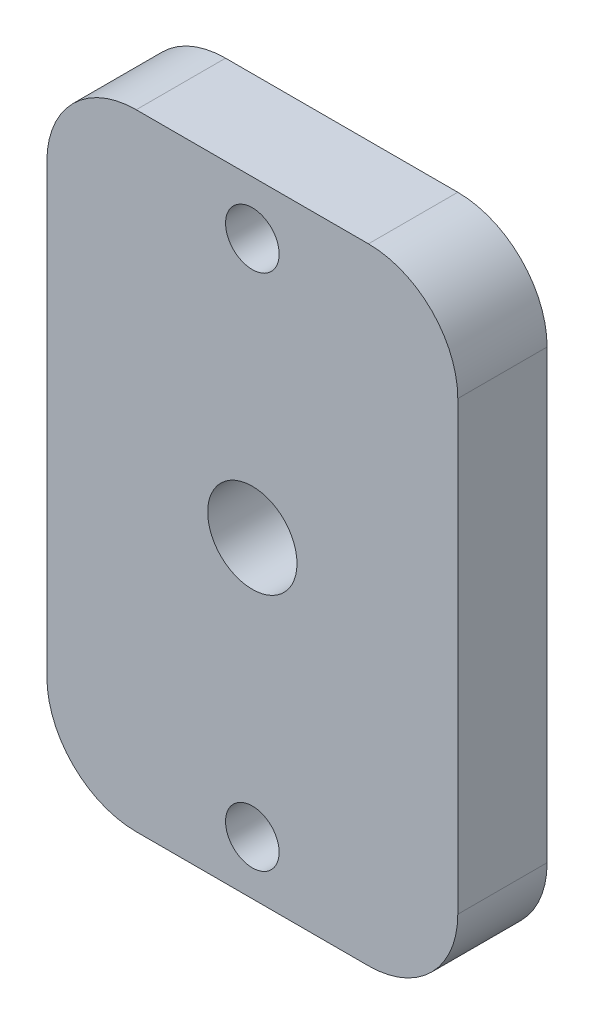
ISO-10303-21;
HEADER;
FILE_DESCRIPTION(('STEP AP214'),'2;1');
FILE_NAME('part.step','',(''),(''),'','','');
FILE_SCHEMA(('AUTOMOTIVE_DESIGN { 1 0 10303 214 1 1 1 1 }'));
ENDSEC;
DATA;
#1=APPLICATION_CONTEXT('core data for automotive mechanical design processes');
#2=APPLICATION_PROTOCOL_DEFINITION('international standard','automotive_design',2000,#1);
#3=PRODUCT_CONTEXT('',#1,'mechanical');
#4=PRODUCT('Part','Part','',(#3));
#5=PRODUCT_RELATED_PRODUCT_CATEGORY('part','',(#4));
#6=PRODUCT_DEFINITION_FORMATION('','',#4);
#7=PRODUCT_DEFINITION_CONTEXT('part definition',#1,'design');
#8=PRODUCT_DEFINITION('design','',#6,#7);
#9=PRODUCT_DEFINITION_SHAPE('','',#8);
#10=(LENGTH_UNIT() NAMED_UNIT(*) SI_UNIT(.MILLI.,.METRE.));
#11=(NAMED_UNIT(*) PLANE_ANGLE_UNIT() SI_UNIT($,.RADIAN.));
#12=(NAMED_UNIT(*) SI_UNIT($,.STERADIAN.) SOLID_ANGLE_UNIT());
#13=UNCERTAINTY_MEASURE_WITH_UNIT(LENGTH_MEASURE(1.E-05),#10,'distance_accuracy_value','');
#14=(GEOMETRIC_REPRESENTATION_CONTEXT(3) GLOBAL_UNCERTAINTY_ASSIGNED_CONTEXT((#13)) GLOBAL_UNIT_ASSIGNED_CONTEXT((#10,
#11,#12)) REPRESENTATION_CONTEXT('',''));
#15=CARTESIAN_POINT('',(0.,0.,0.));
#16=DIRECTION('',(0.,0.,1.));
#17=DIRECTION('',(1.,0.,0.));
#18=AXIS2_PLACEMENT_3D('',#15,#16,#17);
#19=CARTESIAN_POINT('',(0.,0.,5.));
#20=DIRECTION('',(0.,0.,1.));
#21=DIRECTION('',(1.,0.,0.));
#22=AXIS2_PLACEMENT_3D('',#19,#20,#21);
#23=PLANE('',#22);
#24=CARTESIAN_POINT('',(0.,14.5,5.));
#25=DIRECTION('',(0.,0.,1.));
#26=DIRECTION('',(1.,0.,0.));
#27=AXIS2_PLACEMENT_3D('',#24,#25,#26);
#28=CIRCLE('',#27,1.5);
#29=CARTESIAN_POINT('',(1.5,14.5,5.));
#30=VERTEX_POINT('',#29);
#31=EDGE_CURVE('E186',#30,#30,#28,.T.);
#32=ORIENTED_EDGE('',*,*,#31,.F.);
#33=EDGE_LOOP('',(#32));
#34=FACE_BOUND('',#33,.T.);
#35=DIRECTION('',(1.,0.,0.));
#36=VECTOR('',#35,1.);
#37=CARTESIAN_POINT('',(-11.5,-17.5,5.));
#38=LINE('',#37,#36);
#39=CARTESIAN_POINT('',(-6.5,-17.5,5.));
#40=VERTEX_POINT('',#39);
#41=CARTESIAN_POINT('',(6.5,-17.5,5.));
#42=VERTEX_POINT('',#41);
#43=EDGE_CURVE('E172',#40,#42,#38,.T.);
#44=ORIENTED_EDGE('',*,*,#43,.T.);
#45=CARTESIAN_POINT('',(6.5,-12.5,5.));
#46=DIRECTION('',(0.,0.,1.));
#47=DIRECTION('',(1.,0.,0.));
#48=AXIS2_PLACEMENT_3D('',#45,#46,#47);
#49=CIRCLE('',#48,5.);
#50=CARTESIAN_POINT('',(11.5,-12.5,5.));
#51=VERTEX_POINT('',#50);
#52=EDGE_CURVE('E150',#42,#51,#49,.T.);
#53=ORIENTED_EDGE('',*,*,#52,.T.);
#54=DIRECTION('',(0.,1.,0.));
#55=VECTOR('',#54,1.);
#56=CARTESIAN_POINT('',(11.5,17.5,5.));
#57=LINE('',#56,#55);
#58=CARTESIAN_POINT('',(11.5,12.5,5.));
#59=VERTEX_POINT('',#58);
#60=EDGE_CURVE('E120',#51,#59,#57,.T.);
#61=ORIENTED_EDGE('',*,*,#60,.T.);
#62=CARTESIAN_POINT('',(6.5,12.5,5.));
#63=DIRECTION('',(0.,0.,1.));
#64=DIRECTION('',(1.,0.,0.));
#65=AXIS2_PLACEMENT_3D('',#62,#63,#64);
#66=CIRCLE('',#65,5.);
#67=CARTESIAN_POINT('',(6.5,17.5,5.));
#68=VERTEX_POINT('',#67);
#69=EDGE_CURVE('E56',#59,#68,#66,.T.);
#70=ORIENTED_EDGE('',*,*,#69,.T.);
#71=DIRECTION('',(-1.,0.,0.));
#72=VECTOR('',#71,1.);
#73=CARTESIAN_POINT('',(-11.5,17.5,5.));
#74=LINE('',#73,#72);
#75=CARTESIAN_POINT('',(-6.5,17.5,5.));
#76=VERTEX_POINT('',#75);
#77=EDGE_CURVE('E136',#68,#76,#74,.T.);
#78=ORIENTED_EDGE('',*,*,#77,.T.);
#79=CARTESIAN_POINT('',(-6.5,12.5,5.));
#80=DIRECTION('',(0.,0.,1.));
#81=DIRECTION('',(1.,0.,0.));
#82=AXIS2_PLACEMENT_3D('',#79,#80,#81);
#83=CIRCLE('',#82,5.);
#84=CARTESIAN_POINT('',(-11.5,12.5,5.));
#85=VERTEX_POINT('',#84);
#86=EDGE_CURVE('E146',#76,#85,#83,.T.);
#87=ORIENTED_EDGE('',*,*,#86,.T.);
#88=DIRECTION('',(0.,-1.,0.));
#89=VECTOR('',#88,1.);
#90=CARTESIAN_POINT('',(-11.5,17.5,5.));
#91=LINE('',#90,#89);
#92=CARTESIAN_POINT('',(-11.5,-12.5,5.));
#93=VERTEX_POINT('',#92);
#94=EDGE_CURVE('E130',#85,#93,#91,.T.);
#95=ORIENTED_EDGE('',*,*,#94,.T.);
#96=CARTESIAN_POINT('',(-6.5,-12.5,5.));
#97=DIRECTION('',(0.,0.,1.));
#98=DIRECTION('',(1.,0.,0.));
#99=AXIS2_PLACEMENT_3D('',#96,#97,#98);
#100=CIRCLE('',#99,5.);
#101=EDGE_CURVE('E148',#93,#40,#100,.T.);
#102=ORIENTED_EDGE('',*,*,#101,.T.);
#103=EDGE_LOOP('',(#44,#53,#61,#70,#78,#87,#95,#102));
#104=FACE_BOUND('',#103,.T.);
#105=CARTESIAN_POINT('',(0.,0.,5.));
#106=DIRECTION('',(0.,0.,1.));
#107=DIRECTION('',(1.,0.,0.));
#108=AXIS2_PLACEMENT_3D('',#105,#106,#107);
#109=CIRCLE('',#108,2.5);
#110=CARTESIAN_POINT('',(2.5,0.,5.));
#111=VERTEX_POINT('',#110);
#112=EDGE_CURVE('E181',#111,#111,#109,.T.);
#113=ORIENTED_EDGE('',*,*,#112,.F.);
#114=EDGE_LOOP('',(#113));
#115=FACE_BOUND('',#114,.T.);
#116=CARTESIAN_POINT('',(0.,-14.5,5.));
#117=DIRECTION('',(0.,0.,1.));
#118=DIRECTION('',(1.,0.,0.));
#119=AXIS2_PLACEMENT_3D('',#116,#117,#118);
#120=CIRCLE('',#119,1.5);
#121=CARTESIAN_POINT('',(1.5,-14.5,5.));
#122=VERTEX_POINT('',#121);
#123=EDGE_CURVE('E191',#122,#122,#120,.T.);
#124=ORIENTED_EDGE('',*,*,#123,.F.);
#125=EDGE_LOOP('',(#124));
#126=FACE_BOUND('',#125,.T.);
#127=ADVANCED_FACE('F36',(#34,#104,#115,#126),#23,.T.);
#128=CARTESIAN_POINT('',(0.,0.,0.));
#129=DIRECTION('',(0.,0.,1.));
#130=DIRECTION('',(1.,0.,0.));
#131=AXIS2_PLACEMENT_3D('',#128,#129,#130);
#132=PLANE('',#131);
#133=DIRECTION('',(0.,1.,0.));
#134=VECTOR('',#133,1.);
#135=CARTESIAN_POINT('',(11.5,17.5,0.));
#136=LINE('',#135,#134);
#137=CARTESIAN_POINT('',(11.5,-12.5,0.));
#138=VERTEX_POINT('',#137);
#139=CARTESIAN_POINT('',(11.5,12.5,0.));
#140=VERTEX_POINT('',#139);
#141=EDGE_CURVE('E118',#138,#140,#136,.T.);
#142=ORIENTED_EDGE('',*,*,#141,.F.);
#143=CARTESIAN_POINT('',(6.5,-12.5,0.));
#144=DIRECTION('',(0.,0.,1.));
#145=DIRECTION('',(1.,0.,0.));
#146=AXIS2_PLACEMENT_3D('',#143,#144,#145);
#147=CIRCLE('',#146,5.);
#148=CARTESIAN_POINT('',(6.5,-17.5,0.));
#149=VERTEX_POINT('',#148);
#150=EDGE_CURVE('E101',#138,#149,#147,.F.);
#151=ORIENTED_EDGE('',*,*,#150,.T.);
#152=DIRECTION('',(1.,0.,0.));
#153=VECTOR('',#152,1.);
#154=CARTESIAN_POINT('',(-11.5,-17.5,0.));
#155=LINE('',#154,#153);
#156=CARTESIAN_POINT('',(-6.5,-17.5,0.));
#157=VERTEX_POINT('',#156);
#158=EDGE_CURVE('E128',#157,#149,#155,.T.);
#159=ORIENTED_EDGE('',*,*,#158,.F.);
#160=CARTESIAN_POINT('',(-6.5,-12.5,0.));
#161=DIRECTION('',(0.,0.,1.));
#162=DIRECTION('',(1.,0.,0.));
#163=AXIS2_PLACEMENT_3D('',#160,#161,#162);
#164=CIRCLE('',#163,5.);
#165=CARTESIAN_POINT('',(-11.5,-12.5,0.));
#166=VERTEX_POINT('',#165);
#167=EDGE_CURVE('E112',#157,#166,#164,.F.);
#168=ORIENTED_EDGE('',*,*,#167,.T.);
#169=DIRECTION('',(0.,-1.,0.));
#170=VECTOR('',#169,1.);
#171=CARTESIAN_POINT('',(-11.5,17.5,0.));
#172=LINE('',#171,#170);
#173=CARTESIAN_POINT('',(-11.5,12.5,0.));
#174=VERTEX_POINT('',#173);
#175=EDGE_CURVE('E132',#174,#166,#172,.T.);
#176=ORIENTED_EDGE('',*,*,#175,.F.);
#177=CARTESIAN_POINT('',(-6.5,12.5,0.));
#178=DIRECTION('',(0.,0.,1.));
#179=DIRECTION('',(1.,0.,0.));
#180=AXIS2_PLACEMENT_3D('',#177,#178,#179);
#181=CIRCLE('',#180,5.);
#182=CARTESIAN_POINT('',(-6.5,17.5,0.));
#183=VERTEX_POINT('',#182);
#184=EDGE_CURVE('E139',#174,#183,#181,.F.);
#185=ORIENTED_EDGE('',*,*,#184,.T.);
#186=DIRECTION('',(-1.,0.,0.));
#187=VECTOR('',#186,1.);
#188=CARTESIAN_POINT('',(-11.5,17.5,0.));
#189=LINE('',#188,#187);
#190=CARTESIAN_POINT('',(6.5,17.5,0.));
#191=VERTEX_POINT('',#190);
#192=EDGE_CURVE('E127',#191,#183,#189,.T.);
#193=ORIENTED_EDGE('',*,*,#192,.F.);
#194=CARTESIAN_POINT('',(6.5,12.5,0.));
#195=DIRECTION('',(0.,0.,1.));
#196=DIRECTION('',(1.,0.,0.));
#197=AXIS2_PLACEMENT_3D('',#194,#195,#196);
#198=CIRCLE('',#197,5.);
#199=EDGE_CURVE('E121',#191,#140,#198,.F.);
#200=ORIENTED_EDGE('',*,*,#199,.T.);
#201=EDGE_LOOP('',(#142,#151,#159,#168,#176,#185,#193,#200));
#202=FACE_BOUND('',#201,.T.);
#203=CARTESIAN_POINT('',(0.,0.,0.));
#204=DIRECTION('',(0.,0.,1.));
#205=DIRECTION('',(1.,0.,0.));
#206=AXIS2_PLACEMENT_3D('',#203,#204,#205);
#207=CIRCLE('',#206,2.5);
#208=CARTESIAN_POINT('',(2.5,0.,0.));
#209=VERTEX_POINT('',#208);
#210=EDGE_CURVE('E177',#209,#209,#207,.T.);
#211=ORIENTED_EDGE('',*,*,#210,.T.);
#212=EDGE_LOOP('',(#211));
#213=FACE_BOUND('',#212,.T.);
#214=CARTESIAN_POINT('',(0.,14.5,0.));
#215=DIRECTION('',(0.,0.,1.));
#216=DIRECTION('',(1.,0.,0.));
#217=AXIS2_PLACEMENT_3D('',#214,#215,#216);
#218=CIRCLE('',#217,1.5);
#219=CARTESIAN_POINT('',(1.5,14.5,0.));
#220=VERTEX_POINT('',#219);
#221=EDGE_CURVE('E188',#220,#220,#218,.T.);
#222=ORIENTED_EDGE('',*,*,#221,.T.);
#223=EDGE_LOOP('',(#222));
#224=FACE_BOUND('',#223,.T.);
#225=CARTESIAN_POINT('',(0.,-14.5,0.));
#226=DIRECTION('',(0.,0.,1.));
#227=DIRECTION('',(1.,0.,0.));
#228=AXIS2_PLACEMENT_3D('',#225,#226,#227);
#229=CIRCLE('',#228,1.5);
#230=CARTESIAN_POINT('',(1.5,-14.5,0.));
#231=VERTEX_POINT('',#230);
#232=EDGE_CURVE('E194',#231,#231,#229,.T.);
#233=ORIENTED_EDGE('',*,*,#232,.T.);
#234=EDGE_LOOP('',(#233));
#235=FACE_BOUND('',#234,.T.);
#236=ADVANCED_FACE('F124',(#202,#213,#224,#235),#132,.F.);
#237=CARTESIAN_POINT('',(-11.5,17.5,5.));
#238=DIRECTION('',(1.,0.,0.));
#239=DIRECTION('',(0.,0.,-1.));
#240=AXIS2_PLACEMENT_3D('',#237,#238,#239);
#241=PLANE('',#240);
#242=ORIENTED_EDGE('',*,*,#175,.T.);
#243=DIRECTION('',(0.,0.,-1.));
#244=VECTOR('',#243,1.);
#245=CARTESIAN_POINT('',(-11.5,-12.5,5.));
#246=LINE('',#245,#244);
#247=EDGE_CURVE('E155',#166,#93,#246,.F.);
#248=ORIENTED_EDGE('',*,*,#247,.T.);
#249=ORIENTED_EDGE('',*,*,#94,.F.);
#250=DIRECTION('',(0.,0.,-1.));
#251=VECTOR('',#250,1.);
#252=CARTESIAN_POINT('',(-11.5,12.5,5.));
#253=LINE('',#252,#251);
#254=EDGE_CURVE('E152',#85,#174,#253,.T.);
#255=ORIENTED_EDGE('',*,*,#254,.T.);
#256=EDGE_LOOP('',(#242,#248,#249,#255));
#257=FACE_BOUND('',#256,.T.);
#258=ADVANCED_FACE('F168',(#257),#241,.F.);
#259=CARTESIAN_POINT('',(-11.5,-17.5,5.));
#260=DIRECTION('',(0.,1.,0.));
#261=DIRECTION('',(-1.,0.,0.));
#262=AXIS2_PLACEMENT_3D('',#259,#260,#261);
#263=PLANE('',#262);
#264=ORIENTED_EDGE('',*,*,#158,.T.);
#265=DIRECTION('',(0.,0.,-1.));
#266=VECTOR('',#265,1.);
#267=CARTESIAN_POINT('',(6.5,-17.5,5.));
#268=LINE('',#267,#266);
#269=EDGE_CURVE('E106',#149,#42,#268,.F.);
#270=ORIENTED_EDGE('',*,*,#269,.T.);
#271=ORIENTED_EDGE('',*,*,#43,.F.);
#272=DIRECTION('',(0.,0.,-1.));
#273=VECTOR('',#272,1.);
#274=CARTESIAN_POINT('',(-6.5,-17.5,5.));
#275=LINE('',#274,#273);
#276=EDGE_CURVE('E111',#40,#157,#275,.T.);
#277=ORIENTED_EDGE('',*,*,#276,.T.);
#278=EDGE_LOOP('',(#264,#270,#271,#277));
#279=FACE_BOUND('',#278,.T.);
#280=ADVANCED_FACE('F219',(#279),#263,.F.);
#281=CARTESIAN_POINT('',(11.5,17.5,5.));
#282=DIRECTION('',(-1.,0.,0.));
#283=DIRECTION('',(0.,0.,1.));
#284=AXIS2_PLACEMENT_3D('',#281,#282,#283);
#285=PLANE('',#284);
#286=ORIENTED_EDGE('',*,*,#60,.F.);
#287=DIRECTION('',(0.,0.,-1.));
#288=VECTOR('',#287,1.);
#289=CARTESIAN_POINT('',(11.5,-12.5,5.));
#290=LINE('',#289,#288);
#291=EDGE_CURVE('E105',#51,#138,#290,.T.);
#292=ORIENTED_EDGE('',*,*,#291,.T.);
#293=ORIENTED_EDGE('',*,*,#141,.T.);
#294=DIRECTION('',(0.,0.,-1.));
#295=VECTOR('',#294,1.);
#296=CARTESIAN_POINT('',(11.5,12.5,5.));
#297=LINE('',#296,#295);
#298=EDGE_CURVE('E122',#140,#59,#297,.F.);
#299=ORIENTED_EDGE('',*,*,#298,.T.);
#300=EDGE_LOOP('',(#286,#292,#293,#299));
#301=FACE_BOUND('',#300,.T.);
#302=ADVANCED_FACE('F117',(#301),#285,.F.);
#303=CARTESIAN_POINT('',(-11.5,17.5,5.));
#304=DIRECTION('',(0.,-1.,0.));
#305=DIRECTION('',(1.,0.,0.));
#306=AXIS2_PLACEMENT_3D('',#303,#304,#305);
#307=PLANE('',#306);
#308=ORIENTED_EDGE('',*,*,#192,.T.);
#309=DIRECTION('',(0.,0.,-1.));
#310=VECTOR('',#309,1.);
#311=CARTESIAN_POINT('',(-6.5,17.5,5.));
#312=LINE('',#311,#310);
#313=EDGE_CURVE('E11',#183,#76,#312,.F.);
#314=ORIENTED_EDGE('',*,*,#313,.T.);
#315=ORIENTED_EDGE('',*,*,#77,.F.);
#316=DIRECTION('',(0.,0.,-1.));
#317=VECTOR('',#316,1.);
#318=CARTESIAN_POINT('',(6.5,17.5,5.));
#319=LINE('',#318,#317);
#320=EDGE_CURVE('E44',#68,#191,#319,.T.);
#321=ORIENTED_EDGE('',*,*,#320,.T.);
#322=EDGE_LOOP('',(#308,#314,#315,#321));
#323=FACE_BOUND('',#322,.T.);
#324=ADVANCED_FACE('F158',(#323),#307,.F.);
#325=CARTESIAN_POINT('',(0.,0.,5.));
#326=DIRECTION('',(0.,0.,-1.));
#327=DIRECTION('',(-1.,0.,0.));
#328=AXIS2_PLACEMENT_3D('',#325,#326,#327);
#329=CYLINDRICAL_SURFACE('',#328,2.5);
#330=ORIENTED_EDGE('',*,*,#112,.T.);
#331=EDGE_LOOP('',(#330));
#332=FACE_BOUND('',#331,.T.);
#333=ORIENTED_EDGE('',*,*,#210,.F.);
#334=EDGE_LOOP('',(#333));
#335=FACE_BOUND('',#334,.T.);
#336=ADVANCED_FACE('F212',(#332,#335),#329,.F.);
#337=CARTESIAN_POINT('',(0.,14.5,5.));
#338=DIRECTION('',(0.,0.,-1.));
#339=DIRECTION('',(-1.,0.,0.));
#340=AXIS2_PLACEMENT_3D('',#337,#338,#339);
#341=CYLINDRICAL_SURFACE('',#340,1.5);
#342=ORIENTED_EDGE('',*,*,#31,.T.);
#343=EDGE_LOOP('',(#342));
#344=FACE_BOUND('',#343,.T.);
#345=ORIENTED_EDGE('',*,*,#221,.F.);
#346=EDGE_LOOP('',(#345));
#347=FACE_BOUND('',#346,.T.);
#348=ADVANCED_FACE('F300',(#344,#347),#341,.F.);
#349=CARTESIAN_POINT('',(0.,-14.5,5.));
#350=DIRECTION('',(0.,0.,-1.));
#351=DIRECTION('',(-1.,0.,0.));
#352=AXIS2_PLACEMENT_3D('',#349,#350,#351);
#353=CYLINDRICAL_SURFACE('',#352,1.5);
#354=ORIENTED_EDGE('',*,*,#123,.T.);
#355=EDGE_LOOP('',(#354));
#356=FACE_BOUND('',#355,.T.);
#357=ORIENTED_EDGE('',*,*,#232,.F.);
#358=EDGE_LOOP('',(#357));
#359=FACE_BOUND('',#358,.T.);
#360=ADVANCED_FACE('F200',(#356,#359),#353,.F.);
#361=CARTESIAN_POINT('',(6.5,-12.5,5.));
#362=DIRECTION('',(0.,0.,-1.));
#363=DIRECTION('',(-1.,0.,0.));
#364=AXIS2_PLACEMENT_3D('',#361,#362,#363);
#365=CYLINDRICAL_SURFACE('',#364,5.);
#366=ORIENTED_EDGE('',*,*,#52,.F.);
#367=ORIENTED_EDGE('',*,*,#269,.F.);
#368=ORIENTED_EDGE('',*,*,#150,.F.);
#369=ORIENTED_EDGE('',*,*,#291,.F.);
#370=EDGE_LOOP('',(#366,#367,#368,#369));
#371=FACE_BOUND('',#370,.T.);
#372=ADVANCED_FACE('F104',(#371),#365,.T.);
#373=CARTESIAN_POINT('',(-6.5,-12.5,5.));
#374=DIRECTION('',(0.,0.,-1.));
#375=DIRECTION('',(-1.,0.,0.));
#376=AXIS2_PLACEMENT_3D('',#373,#374,#375);
#377=CYLINDRICAL_SURFACE('',#376,5.);
#378=ORIENTED_EDGE('',*,*,#101,.F.);
#379=ORIENTED_EDGE('',*,*,#247,.F.);
#380=ORIENTED_EDGE('',*,*,#167,.F.);
#381=ORIENTED_EDGE('',*,*,#276,.F.);
#382=EDGE_LOOP('',(#378,#379,#380,#381));
#383=FACE_BOUND('',#382,.T.);
#384=ADVANCED_FACE('F227',(#383),#377,.T.);
#385=CARTESIAN_POINT('',(-6.5,12.5,5.));
#386=DIRECTION('',(0.,0.,-1.));
#387=DIRECTION('',(-1.,0.,0.));
#388=AXIS2_PLACEMENT_3D('',#385,#386,#387);
#389=CYLINDRICAL_SURFACE('',#388,5.);
#390=ORIENTED_EDGE('',*,*,#86,.F.);
#391=ORIENTED_EDGE('',*,*,#313,.F.);
#392=ORIENTED_EDGE('',*,*,#184,.F.);
#393=ORIENTED_EDGE('',*,*,#254,.F.);
#394=EDGE_LOOP('',(#390,#391,#392,#393));
#395=FACE_BOUND('',#394,.T.);
#396=ADVANCED_FACE('F165',(#395),#389,.T.);
#397=CARTESIAN_POINT('',(6.5,12.5,5.));
#398=DIRECTION('',(0.,0.,-1.));
#399=DIRECTION('',(-1.,0.,0.));
#400=AXIS2_PLACEMENT_3D('',#397,#398,#399);
#401=CYLINDRICAL_SURFACE('',#400,5.);
#402=ORIENTED_EDGE('',*,*,#69,.F.);
#403=ORIENTED_EDGE('',*,*,#298,.F.);
#404=ORIENTED_EDGE('',*,*,#199,.F.);
#405=ORIENTED_EDGE('',*,*,#320,.F.);
#406=EDGE_LOOP('',(#402,#403,#404,#405));
#407=FACE_BOUND('',#406,.T.);
#408=ADVANCED_FACE('F38',(#407),#401,.T.);
#409=CLOSED_SHELL('',(#127,#236,#258,#280,#302,#324,#336,#348,#360,#372,#384,#396,#408));
#410=MANIFOLD_SOLID_BREP('B2',#409);
#411=ADVANCED_BREP_SHAPE_REPRESENTATION('',(#18,#410),#14);
#412=SHAPE_DEFINITION_REPRESENTATION(#9,#411);
ENDSEC;
END-ISO-10303-21;
